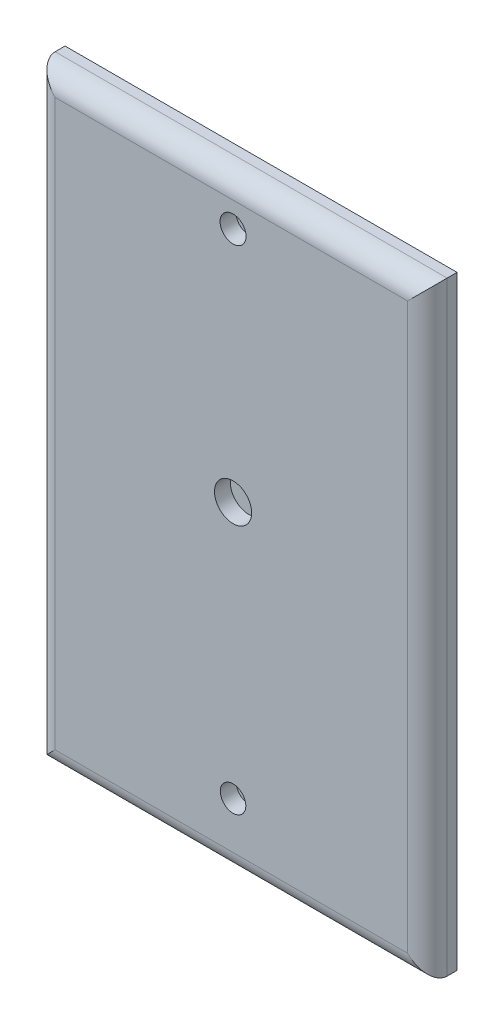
ISO-10303-21;
HEADER;
FILE_DESCRIPTION(('STEP AP214'),'2;1');
FILE_NAME('part.step','',(''),(''),'','','');
FILE_SCHEMA(('AUTOMOTIVE_DESIGN { 1 0 10303 214 1 1 1 1 }'));
ENDSEC;
DATA;
#1=APPLICATION_CONTEXT('core data for automotive mechanical design processes');
#2=APPLICATION_PROTOCOL_DEFINITION('international standard','automotive_design',2000,#1);
#3=PRODUCT_CONTEXT('',#1,'mechanical');
#4=PRODUCT('Part','Part','',(#3));
#5=PRODUCT_RELATED_PRODUCT_CATEGORY('part','',(#4));
#6=PRODUCT_DEFINITION_FORMATION('','',#4);
#7=PRODUCT_DEFINITION_CONTEXT('part definition',#1,'design');
#8=PRODUCT_DEFINITION('design','',#6,#7);
#9=PRODUCT_DEFINITION_SHAPE('','',#8);
#10=(LENGTH_UNIT() NAMED_UNIT(*) SI_UNIT(.MILLI.,.METRE.));
#11=(NAMED_UNIT(*) PLANE_ANGLE_UNIT() SI_UNIT($,.RADIAN.));
#12=(NAMED_UNIT(*) SI_UNIT($,.STERADIAN.) SOLID_ANGLE_UNIT());
#13=UNCERTAINTY_MEASURE_WITH_UNIT(LENGTH_MEASURE(1.E-05),#10,'distance_accuracy_value','');
#14=(GEOMETRIC_REPRESENTATION_CONTEXT(3) GLOBAL_UNCERTAINTY_ASSIGNED_CONTEXT((#13)) GLOBAL_UNIT_ASSIGNED_CONTEXT((#10,
#11,#12)) REPRESENTATION_CONTEXT('',''));
#15=CARTESIAN_POINT('',(0.,0.,0.));
#16=DIRECTION('',(0.,0.,1.));
#17=DIRECTION('',(1.,0.,0.));
#18=AXIS2_PLACEMENT_3D('',#15,#16,#17);
#19=CARTESIAN_POINT('',(-114.429040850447,144.440384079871,15.24));
#20=DIRECTION('',(1.,0.,0.));
#21=DIRECTION('',(0.,1.,0.));
#22=AXIS2_PLACEMENT_3D('',#19,#20,#21);
#23=PLANE('',#22);
#24=DIRECTION('',(0.,0.,-1.));
#25=VECTOR('',#24,1.);
#26=CARTESIAN_POINT('',(-114.429040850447,-165.871751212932,15.24));
#27=LINE('',#26,#25);
#28=CARTESIAN_POINT('',(-114.429040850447,-165.871751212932,5.08));
#29=VERTEX_POINT('',#28);
#30=CARTESIAN_POINT('',(-114.429040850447,-165.871751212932,0.));
#31=VERTEX_POINT('',#30);
#32=EDGE_CURVE('E84',#29,#31,#27,.T.);
#33=ORIENTED_EDGE('',*,*,#32,.F.);
#34=DIRECTION('',(0.,-1.,0.));
#35=VECTOR('',#34,1.);
#36=CARTESIAN_POINT('',(-114.429040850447,144.440384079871,5.08));
#37=LINE('',#36,#35);
#38=CARTESIAN_POINT('',(-114.429040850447,144.440384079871,5.08));
#39=VERTEX_POINT('',#38);
#40=EDGE_CURVE('E130',#29,#39,#37,.F.);
#41=ORIENTED_EDGE('',*,*,#40,.T.);
#42=DIRECTION('',(0.,0.,-1.));
#43=VECTOR('',#42,1.);
#44=CARTESIAN_POINT('',(-114.429040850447,144.440384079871,15.24));
#45=LINE('',#44,#43);
#46=CARTESIAN_POINT('',(-114.429040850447,144.440384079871,0.));
#47=VERTEX_POINT('',#46);
#48=EDGE_CURVE('E106',#39,#47,#45,.T.);
#49=ORIENTED_EDGE('',*,*,#48,.T.);
#50=DIRECTION('',(0.,-1.,0.));
#51=VECTOR('',#50,1.);
#52=CARTESIAN_POINT('',(-114.429040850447,144.440384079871,0.));
#53=LINE('',#52,#51);
#54=EDGE_CURVE('E102',#47,#31,#53,.T.);
#55=ORIENTED_EDGE('',*,*,#54,.T.);
#56=EDGE_LOOP('',(#33,#41,#49,#55));
#57=FACE_BOUND('',#56,.T.);
#58=ADVANCED_FACE('F31',(#57),#23,.F.);
#59=CARTESIAN_POINT('',(-114.429040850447,-165.871751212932,15.24));
#60=DIRECTION('',(0.,1.,0.));
#61=DIRECTION('',(0.,0.,1.));
#62=AXIS2_PLACEMENT_3D('',#59,#60,#61);
#63=PLANE('',#62);
#64=DIRECTION('',(0.,0.,-1.));
#65=VECTOR('',#64,1.);
#66=CARTESIAN_POINT('',(86.803470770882,-165.871751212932,15.24));
#67=LINE('',#66,#65);
#68=CARTESIAN_POINT('',(86.803470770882,-165.871751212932,5.08));
#69=VERTEX_POINT('',#68);
#70=CARTESIAN_POINT('',(86.803470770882,-165.871751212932,0.));
#71=VERTEX_POINT('',#70);
#72=EDGE_CURVE('E96',#69,#71,#67,.T.);
#73=ORIENTED_EDGE('',*,*,#72,.F.);
#74=DIRECTION('',(1.,0.,0.));
#75=VECTOR('',#74,1.);
#76=CARTESIAN_POINT('',(-114.429040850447,-165.871751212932,5.08));
#77=LINE('',#76,#75);
#78=EDGE_CURVE('E90',#69,#29,#77,.F.);
#79=ORIENTED_EDGE('',*,*,#78,.T.);
#80=ORIENTED_EDGE('',*,*,#32,.T.);
#81=DIRECTION('',(1.,0.,0.));
#82=VECTOR('',#81,1.);
#83=CARTESIAN_POINT('',(-114.429040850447,-165.871751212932,0.));
#84=LINE('',#83,#82);
#85=EDGE_CURVE('E87',#31,#71,#84,.T.);
#86=ORIENTED_EDGE('',*,*,#85,.T.);
#87=EDGE_LOOP('',(#73,#79,#80,#86));
#88=FACE_BOUND('',#87,.T.);
#89=ADVANCED_FACE('F86',(#88),#63,.F.);
#90=CARTESIAN_POINT('',(86.803470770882,144.440384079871,15.24));
#91=DIRECTION('',(-1.,0.,0.));
#92=DIRECTION('',(0.,0.,1.));
#93=AXIS2_PLACEMENT_3D('',#90,#91,#92);
#94=PLANE('',#93);
#95=DIRECTION('',(0.,0.,-1.));
#96=VECTOR('',#95,1.);
#97=CARTESIAN_POINT('',(86.803470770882,144.440384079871,15.24));
#98=LINE('',#97,#96);
#99=CARTESIAN_POINT('',(86.803470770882,144.440384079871,5.08));
#100=VERTEX_POINT('',#99);
#101=CARTESIAN_POINT('',(86.803470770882,144.440384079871,0.));
#102=VERTEX_POINT('',#101);
#103=EDGE_CURVE('E119',#100,#102,#98,.T.);
#104=ORIENTED_EDGE('',*,*,#103,.F.);
#105=DIRECTION('',(0.,1.,0.));
#106=VECTOR('',#105,1.);
#107=CARTESIAN_POINT('',(86.803470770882,-165.871751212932,5.08));
#108=LINE('',#107,#106);
#109=EDGE_CURVE('E40',#100,#69,#108,.F.);
#110=ORIENTED_EDGE('',*,*,#109,.T.);
#111=ORIENTED_EDGE('',*,*,#72,.T.);
#112=DIRECTION('',(0.,1.,0.));
#113=VECTOR('',#112,1.);
#114=CARTESIAN_POINT('',(86.803470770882,144.440384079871,0.));
#115=LINE('',#114,#113);
#116=EDGE_CURVE('E104',#71,#102,#115,.T.);
#117=ORIENTED_EDGE('',*,*,#116,.T.);
#118=EDGE_LOOP('',(#104,#110,#111,#117));
#119=FACE_BOUND('',#118,.T.);
#120=ADVANCED_FACE('F191',(#119),#94,.F.);
#121=CARTESIAN_POINT('',(-114.429040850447,144.440384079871,15.24));
#122=DIRECTION('',(0.,-1.,0.));
#123=DIRECTION('',(0.,0.,-1.));
#124=AXIS2_PLACEMENT_3D('',#121,#122,#123);
#125=PLANE('',#124);
#126=ORIENTED_EDGE('',*,*,#48,.F.);
#127=DIRECTION('',(-1.,0.,0.));
#128=VECTOR('',#127,1.);
#129=CARTESIAN_POINT('',(86.803470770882,144.440384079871,5.08));
#130=LINE('',#129,#128);
#131=EDGE_CURVE('E11',#39,#100,#130,.F.);
#132=ORIENTED_EDGE('',*,*,#131,.T.);
#133=ORIENTED_EDGE('',*,*,#103,.T.);
#134=DIRECTION('',(-1.,0.,0.));
#135=VECTOR('',#134,1.);
#136=CARTESIAN_POINT('',(-114.429040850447,144.440384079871,0.));
#137=LINE('',#136,#135);
#138=EDGE_CURVE('E116',#102,#47,#137,.T.);
#139=ORIENTED_EDGE('',*,*,#138,.T.);
#140=EDGE_LOOP('',(#126,#132,#133,#139));
#141=FACE_BOUND('',#140,.T.);
#142=ADVANCED_FACE('F167',(#141),#125,.F.);
#143=CARTESIAN_POINT('',(-114.429040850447,-165.871751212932,15.24));
#144=DIRECTION('',(0.,0.,1.));
#145=DIRECTION('',(1.,0.,0.));
#146=AXIS2_PLACEMENT_3D('',#143,#144,#145);
#147=PLANE('',#146);
#148=DIRECTION('',(-1.,0.,0.));
#149=VECTOR('',#148,1.);
#150=CARTESIAN_POINT('',(-114.429040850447,134.280384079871,15.24));
#151=LINE('',#150,#149);
#152=CARTESIAN_POINT('',(76.643470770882,134.280384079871,15.24));
#153=VERTEX_POINT('',#152);
#154=CARTESIAN_POINT('',(-104.269040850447,134.280384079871,15.24));
#155=VERTEX_POINT('',#154);
#156=EDGE_CURVE('E95',#153,#155,#151,.T.);
#157=ORIENTED_EDGE('',*,*,#156,.T.);
#158=DIRECTION('',(0.,-1.,0.));
#159=VECTOR('',#158,1.);
#160=CARTESIAN_POINT('',(-104.269040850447,-165.871751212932,15.24));
#161=LINE('',#160,#159);
#162=CARTESIAN_POINT('',(-104.269040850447,-155.711751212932,15.24));
#163=VERTEX_POINT('',#162);
#164=EDGE_CURVE('E127',#155,#163,#161,.T.);
#165=ORIENTED_EDGE('',*,*,#164,.T.);
#166=DIRECTION('',(1.,0.,0.));
#167=VECTOR('',#166,1.);
#168=CARTESIAN_POINT('',(86.803470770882,-155.711751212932,15.24));
#169=LINE('',#168,#167);
#170=CARTESIAN_POINT('',(76.643470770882,-155.711751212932,15.24));
#171=VERTEX_POINT('',#170);
#172=EDGE_CURVE('E125',#163,#171,#169,.T.);
#173=ORIENTED_EDGE('',*,*,#172,.T.);
#174=DIRECTION('',(0.,1.,0.));
#175=VECTOR('',#174,1.);
#176=CARTESIAN_POINT('',(76.643470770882,144.440384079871,15.24));
#177=LINE('',#176,#175);
#178=EDGE_CURVE('E123',#171,#153,#177,.T.);
#179=ORIENTED_EDGE('',*,*,#178,.T.);
#180=EDGE_LOOP('',(#157,#165,#173,#179));
#181=FACE_BOUND('',#180,.T.);
#182=CARTESIAN_POINT('',(-12.9354259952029,0.,15.24));
#183=DIRECTION('',(0.,0.,1.));
#184=DIRECTION('',(1.,0.,0.));
#185=AXIS2_PLACEMENT_3D('',#182,#183,#184);
#186=CIRCLE('',#185,9.525);
#187=CARTESIAN_POINT('',(-3.41042599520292,0.,15.24));
#188=VERTEX_POINT('',#187);
#189=EDGE_CURVE('E143',#188,#188,#186,.T.);
#190=ORIENTED_EDGE('',*,*,#189,.F.);
#191=EDGE_LOOP('',(#190));
#192=FACE_BOUND('',#191,.T.);
#193=CARTESIAN_POINT('',(-12.9354259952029,-131.710621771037,15.24));
#194=DIRECTION('',(0.,0.,1.));
#195=DIRECTION('',(1.,0.,0.));
#196=AXIS2_PLACEMENT_3D('',#193,#194,#195);
#197=CIRCLE('',#196,6.54884368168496);
#198=CARTESIAN_POINT('',(-6.38658231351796,-131.710621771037,15.24));
#199=VERTEX_POINT('',#198);
#200=EDGE_CURVE('E153',#199,#199,#197,.T.);
#201=ORIENTED_EDGE('',*,*,#200,.F.);
#202=EDGE_LOOP('',(#201));
#203=FACE_BOUND('',#202,.T.);
#204=CARTESIAN_POINT('',(-12.9354259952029,121.483730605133,15.24));
#205=DIRECTION('',(0.,0.,1.));
#206=DIRECTION('',(1.,0.,0.));
#207=AXIS2_PLACEMENT_3D('',#204,#205,#206);
#208=CIRCLE('',#207,6.67270718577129);
#209=CARTESIAN_POINT('',(-6.26271880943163,121.483730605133,15.24));
#210=VERTEX_POINT('',#209);
#211=EDGE_CURVE('E111',#210,#210,#208,.T.);
#212=ORIENTED_EDGE('',*,*,#211,.F.);
#213=EDGE_LOOP('',(#212));
#214=FACE_BOUND('',#213,.T.);
#215=ADVANCED_FACE('F164',(#181,#192,#203,#214),#147,.T.);
#216=CARTESIAN_POINT('',(-114.429040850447,-165.871751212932,0.));
#217=DIRECTION('',(0.,0.,1.));
#218=DIRECTION('',(1.,0.,0.));
#219=AXIS2_PLACEMENT_3D('',#216,#217,#218);
#220=PLANE('',#219);
#221=ORIENTED_EDGE('',*,*,#54,.F.);
#222=ORIENTED_EDGE('',*,*,#138,.F.);
#223=ORIENTED_EDGE('',*,*,#116,.F.);
#224=ORIENTED_EDGE('',*,*,#85,.F.);
#225=EDGE_LOOP('',(#221,#222,#223,#224));
#226=FACE_BOUND('',#225,.T.);
#227=ADVANCED_FACE('F100',(#226),#220,.F.);
#228=CARTESIAN_POINT('',(-12.9354259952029,121.483730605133,7.11199999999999));
#229=DIRECTION('',(0.,0.,1.));
#230=DIRECTION('',(1.,0.,0.));
#231=AXIS2_PLACEMENT_3D('',#228,#229,#230);
#232=CYLINDRICAL_SURFACE('',#231,6.67270718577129);
#233=CARTESIAN_POINT('',(-12.9354259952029,121.483730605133,7.11199999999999));
#234=DIRECTION('',(0.,0.,1.));
#235=DIRECTION('',(1.,0.,0.));
#236=AXIS2_PLACEMENT_3D('',#233,#234,#235);
#237=CIRCLE('',#236,6.67270718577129);
#238=CARTESIAN_POINT('',(-6.26271880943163,121.483730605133,7.11199999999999));
#239=VERTEX_POINT('',#238);
#240=EDGE_CURVE('E108',#239,#239,#237,.T.);
#241=ORIENTED_EDGE('',*,*,#240,.F.);
#242=EDGE_LOOP('',(#241));
#243=FACE_BOUND('',#242,.T.);
#244=ORIENTED_EDGE('',*,*,#211,.T.);
#245=EDGE_LOOP('',(#244));
#246=FACE_BOUND('',#245,.T.);
#247=ADVANCED_FACE('F173',(#243,#246),#232,.F.);
#248=CARTESIAN_POINT('',(-12.9354259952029,121.483730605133,7.11199999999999));
#249=DIRECTION('',(0.,0.,1.));
#250=DIRECTION('',(1.,0.,0.));
#251=AXIS2_PLACEMENT_3D('',#248,#249,#250);
#252=PLANE('',#251);
#253=ORIENTED_EDGE('',*,*,#240,.T.);
#254=EDGE_LOOP('',(#253));
#255=FACE_BOUND('',#254,.T.);
#256=ADVANCED_FACE('F175',(#255),#252,.T.);
#257=CARTESIAN_POINT('',(-12.9354259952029,-131.710621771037,7.11199999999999));
#258=DIRECTION('',(0.,0.,1.));
#259=DIRECTION('',(1.,0.,0.));
#260=AXIS2_PLACEMENT_3D('',#257,#258,#259);
#261=CYLINDRICAL_SURFACE('',#260,6.54884368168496);
#262=CARTESIAN_POINT('',(-12.9354259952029,-131.710621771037,7.11199999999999));
#263=DIRECTION('',(0.,0.,1.));
#264=DIRECTION('',(1.,0.,0.));
#265=AXIS2_PLACEMENT_3D('',#262,#263,#264);
#266=CIRCLE('',#265,6.54884368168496);
#267=CARTESIAN_POINT('',(-6.38658231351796,-131.710621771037,7.11199999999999));
#268=VERTEX_POINT('',#267);
#269=EDGE_CURVE('E156',#268,#268,#266,.T.);
#270=ORIENTED_EDGE('',*,*,#269,.F.);
#271=EDGE_LOOP('',(#270));
#272=FACE_BOUND('',#271,.T.);
#273=ORIENTED_EDGE('',*,*,#200,.T.);
#274=EDGE_LOOP('',(#273));
#275=FACE_BOUND('',#274,.T.);
#276=ADVANCED_FACE('F162',(#272,#275),#261,.F.);
#277=CARTESIAN_POINT('',(-12.9354259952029,-131.710621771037,7.11199999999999));
#278=DIRECTION('',(0.,0.,1.));
#279=DIRECTION('',(1.,0.,0.));
#280=AXIS2_PLACEMENT_3D('',#277,#278,#279);
#281=PLANE('',#280);
#282=ORIENTED_EDGE('',*,*,#269,.T.);
#283=EDGE_LOOP('',(#282));
#284=FACE_BOUND('',#283,.T.);
#285=ADVANCED_FACE('F252',(#284),#281,.T.);
#286=CARTESIAN_POINT('',(-12.9354259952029,0.,7.11199999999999));
#287=DIRECTION('',(0.,0.,1.));
#288=DIRECTION('',(1.,0.,0.));
#289=AXIS2_PLACEMENT_3D('',#286,#287,#288);
#290=CYLINDRICAL_SURFACE('',#289,9.525);
#291=CARTESIAN_POINT('',(-12.9354259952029,0.,7.11199999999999));
#292=DIRECTION('',(0.,0.,1.));
#293=DIRECTION('',(1.,0.,0.));
#294=AXIS2_PLACEMENT_3D('',#291,#292,#293);
#295=CIRCLE('',#294,9.525);
#296=CARTESIAN_POINT('',(-3.41042599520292,0.,7.11199999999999));
#297=VERTEX_POINT('',#296);
#298=EDGE_CURVE('E148',#297,#297,#295,.T.);
#299=ORIENTED_EDGE('',*,*,#298,.F.);
#300=EDGE_LOOP('',(#299));
#301=FACE_BOUND('',#300,.T.);
#302=ORIENTED_EDGE('',*,*,#189,.T.);
#303=EDGE_LOOP('',(#302));
#304=FACE_BOUND('',#303,.T.);
#305=ADVANCED_FACE('F211',(#301,#304),#290,.F.);
#306=CARTESIAN_POINT('',(-12.9354259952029,0.,7.11199999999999));
#307=DIRECTION('',(0.,0.,1.));
#308=DIRECTION('',(1.,0.,0.));
#309=AXIS2_PLACEMENT_3D('',#306,#307,#308);
#310=PLANE('',#309);
#311=ORIENTED_EDGE('',*,*,#298,.T.);
#312=EDGE_LOOP('',(#311));
#313=FACE_BOUND('',#312,.T.);
#314=ADVANCED_FACE('F206',(#313),#310,.T.);
#315=CARTESIAN_POINT('',(76.643470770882,-165.871751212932,5.08));
#316=DIRECTION('',(0.,-1.,0.));
#317=DIRECTION('',(0.,0.,-1.));
#318=AXIS2_PLACEMENT_3D('',#315,#316,#317);
#319=CYLINDRICAL_SURFACE('',#318,10.16);
#320=CARTESIAN_POINT('',(76.643470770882,-155.711751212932,5.08));
#321=DIRECTION('',(-0.707106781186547,-0.707106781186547,0.));
#322=DIRECTION('',(0.707106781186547,-0.707106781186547,0.));
#323=AXIS2_PLACEMENT_3D('',#320,#321,#322);
#324=ELLIPSE('',#323,14.3684097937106,10.16);
#325=EDGE_CURVE('E137',#69,#171,#324,.T.);
#326=ORIENTED_EDGE('',*,*,#325,.F.);
#327=ORIENTED_EDGE('',*,*,#109,.F.);
#328=CARTESIAN_POINT('',(76.643470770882,134.280384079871,5.08));
#329=DIRECTION('',(0.707106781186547,-0.707106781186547,0.));
#330=DIRECTION('',(0.707106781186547,0.707106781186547,0.));
#331=AXIS2_PLACEMENT_3D('',#328,#329,#330);
#332=ELLIPSE('',#331,14.3684097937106,10.16);
#333=EDGE_CURVE('E35',#153,#100,#332,.F.);
#334=ORIENTED_EDGE('',*,*,#333,.F.);
#335=ORIENTED_EDGE('',*,*,#178,.F.);
#336=EDGE_LOOP('',(#326,#327,#334,#335));
#337=FACE_BOUND('',#336,.T.);
#338=ADVANCED_FACE('F33',(#337),#319,.T.);
#339=CARTESIAN_POINT('',(-114.429040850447,134.280384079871,5.08));
#340=DIRECTION('',(1.,0.,0.));
#341=DIRECTION('',(0.,0.,-1.));
#342=AXIS2_PLACEMENT_3D('',#339,#340,#341);
#343=CYLINDRICAL_SURFACE('',#342,10.16);
#344=ORIENTED_EDGE('',*,*,#333,.T.);
#345=ORIENTED_EDGE('',*,*,#131,.F.);
#346=CARTESIAN_POINT('',(-104.269040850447,134.280384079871,5.08));
#347=DIRECTION('',(0.707106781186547,0.707106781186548,0.));
#348=DIRECTION('',(0.707106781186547,-0.707106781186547,0.));
#349=AXIS2_PLACEMENT_3D('',#346,#347,#348);
#350=ELLIPSE('',#349,14.3684097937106,10.16);
#351=EDGE_CURVE('E136',#155,#39,#350,.F.);
#352=ORIENTED_EDGE('',*,*,#351,.F.);
#353=ORIENTED_EDGE('',*,*,#156,.F.);
#354=EDGE_LOOP('',(#344,#345,#352,#353));
#355=FACE_BOUND('',#354,.T.);
#356=ADVANCED_FACE('F201',(#355),#343,.T.);
#357=CARTESIAN_POINT('',(-114.429040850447,-155.711751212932,5.08));
#358=DIRECTION('',(-1.,0.,0.));
#359=DIRECTION('',(0.,0.,1.));
#360=AXIS2_PLACEMENT_3D('',#357,#358,#359);
#361=CYLINDRICAL_SURFACE('',#360,10.16);
#362=ORIENTED_EDGE('',*,*,#325,.T.);
#363=ORIENTED_EDGE('',*,*,#172,.F.);
#364=CARTESIAN_POINT('',(-104.269040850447,-155.711751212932,5.08));
#365=DIRECTION('',(-0.707106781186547,0.707106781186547,0.));
#366=DIRECTION('',(-0.707106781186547,-0.707106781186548,0.));
#367=AXIS2_PLACEMENT_3D('',#364,#365,#366);
#368=ELLIPSE('',#367,14.3684097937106,10.16);
#369=EDGE_CURVE('E134',#29,#163,#368,.T.);
#370=ORIENTED_EDGE('',*,*,#369,.F.);
#371=ORIENTED_EDGE('',*,*,#78,.F.);
#372=EDGE_LOOP('',(#362,#363,#370,#371));
#373=FACE_BOUND('',#372,.T.);
#374=ADVANCED_FACE('F198',(#373),#361,.T.);
#375=CARTESIAN_POINT('',(-104.269040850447,-165.871751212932,5.08));
#376=DIRECTION('',(0.,1.,0.));
#377=DIRECTION('',(-1.,0.,0.));
#378=AXIS2_PLACEMENT_3D('',#375,#376,#377);
#379=CYLINDRICAL_SURFACE('',#378,10.16);
#380=ORIENTED_EDGE('',*,*,#351,.T.);
#381=ORIENTED_EDGE('',*,*,#40,.F.);
#382=ORIENTED_EDGE('',*,*,#369,.T.);
#383=ORIENTED_EDGE('',*,*,#164,.F.);
#384=EDGE_LOOP('',(#380,#381,#382,#383));
#385=FACE_BOUND('',#384,.T.);
#386=ADVANCED_FACE('F195',(#385),#379,.T.);
#387=CLOSED_SHELL('',(#58,#89,#120,#142,#215,#227,#247,#256,#276,#285,#305,#314,#338,#356,#374,#386));
#388=MANIFOLD_SOLID_BREP('B2',#387);
#389=ADVANCED_BREP_SHAPE_REPRESENTATION('',(#18,#388),#14);
#390=SHAPE_DEFINITION_REPRESENTATION(#9,#389);
ENDSEC;
END-ISO-10303-21;
